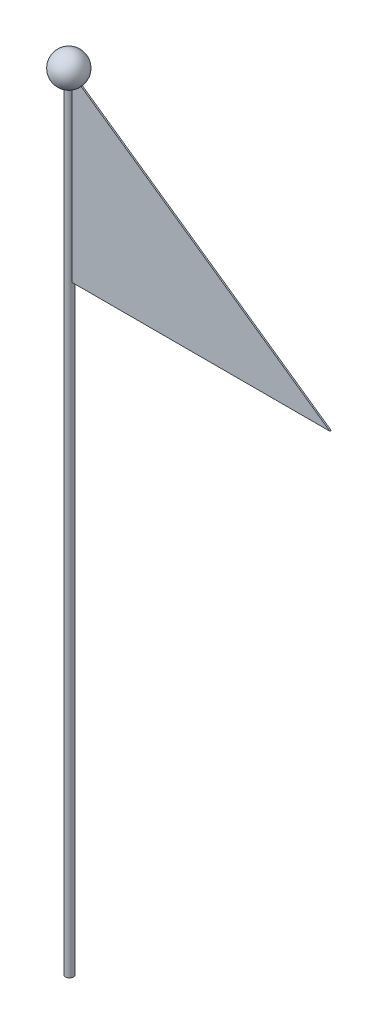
from build123d import *

# Parameters (mm, degrees)
BOSS_EXTRUDE1_DEPTH      = 0.5
BOSS_EXTRUDE1_DEPTH_BACK = 0.5
SKETCH2_R                = 3
BOSS_EXTRUDE2_DEPTH      = 600


with BuildPart() as part:
    # Sketch1 → Boss-Extrude1 (new, two sides: drawn at the far end of the back side and taken through both)
    with BuildSketch(Plane.XY.offset(-BOSS_EXTRUDE1_DEPTH_BACK)):
        Polygon((0, 0), (0, -140), (200, -140), align=None)
    extrude(amount=BOSS_EXTRUDE1_DEPTH + BOSS_EXTRUDE1_DEPTH_BACK)

    # Sketch2 → Boss-Extrude2 (add)
    with BuildSketch(Plane(origin=(0, 0, 0), x_dir=(1, 0, 0), z_dir=(0, 1, 0))):
        with Locations(Location((0, 0.5, 0), (0, 0, 270))):
            Circle(SKETCH2_R)
    extrude(amount=-BOSS_EXTRUDE2_DEPTH)

    # Sketch3 → Revolve1 (revolve)
    with BuildSketch(Plane.XY):
        with BuildLine():
            Line((0, 12), (0, -12))
            ThreePointArc((0, -12), (-12, 0), (0, 12))
        make_face()
    revolve(axis=Axis((0, 12, 0), (0, -1, 0)))


solid = part.part
